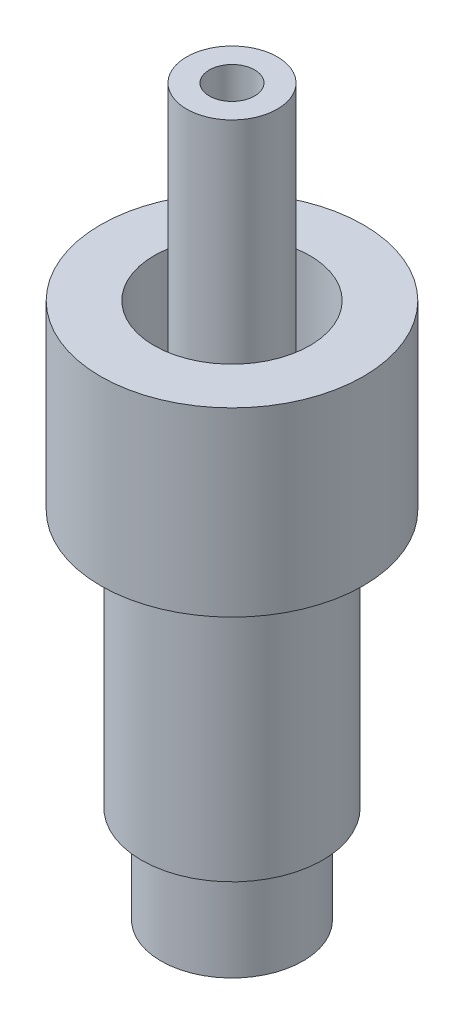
ISO-10303-21;
HEADER;
FILE_DESCRIPTION(('STEP AP214'),'2;1');
FILE_NAME('part.step','',(''),(''),'','','');
FILE_SCHEMA(('AUTOMOTIVE_DESIGN { 1 0 10303 214 1 1 1 1 }'));
ENDSEC;
DATA;
#1=APPLICATION_CONTEXT('core data for automotive mechanical design processes');
#2=APPLICATION_PROTOCOL_DEFINITION('international standard','automotive_design',2000,#1);
#3=PRODUCT_CONTEXT('',#1,'mechanical');
#4=PRODUCT('Part','Part','',(#3));
#5=PRODUCT_RELATED_PRODUCT_CATEGORY('part','',(#4));
#6=PRODUCT_DEFINITION_FORMATION('','',#4);
#7=PRODUCT_DEFINITION_CONTEXT('part definition',#1,'design');
#8=PRODUCT_DEFINITION('design','',#6,#7);
#9=PRODUCT_DEFINITION_SHAPE('','',#8);
#10=(LENGTH_UNIT() NAMED_UNIT(*) SI_UNIT(.MILLI.,.METRE.));
#11=(NAMED_UNIT(*) PLANE_ANGLE_UNIT() SI_UNIT($,.RADIAN.));
#12=(NAMED_UNIT(*) SI_UNIT($,.STERADIAN.) SOLID_ANGLE_UNIT());
#13=UNCERTAINTY_MEASURE_WITH_UNIT(LENGTH_MEASURE(1.E-05),#10,'distance_accuracy_value','');
#14=(GEOMETRIC_REPRESENTATION_CONTEXT(3) GLOBAL_UNCERTAINTY_ASSIGNED_CONTEXT((#13)) GLOBAL_UNIT_ASSIGNED_CONTEXT((#10,
#11,#12)) REPRESENTATION_CONTEXT('',''));
#15=CARTESIAN_POINT('',(0.,0.,0.));
#16=DIRECTION('',(0.,0.,1.));
#17=DIRECTION('',(1.,0.,0.));
#18=AXIS2_PLACEMENT_3D('',#15,#16,#17);
#19=CARTESIAN_POINT('',(0.,6.604,0.));
#20=DIRECTION('',(0.,-1.,0.));
#21=DIRECTION('',(0.,0.,-1.));
#22=AXIS2_PLACEMENT_3D('',#19,#20,#21);
#23=CYLINDRICAL_SURFACE('',#22,1.5875);
#24=CARTESIAN_POINT('',(0.,6.604,0.));
#25=DIRECTION('',(0.,-1.,0.));
#26=DIRECTION('',(0.,0.,-1.));
#27=AXIS2_PLACEMENT_3D('',#24,#25,#26);
#28=CIRCLE('',#27,1.5875);
#29=CARTESIAN_POINT('',(0.,6.604,-1.5875));
#30=VERTEX_POINT('',#29);
#31=EDGE_CURVE('E11',#30,#30,#28,.T.);
#32=ORIENTED_EDGE('',*,*,#31,.T.);
#33=EDGE_LOOP('',(#32));
#34=FACE_BOUND('',#33,.T.);
#35=CARTESIAN_POINT('',(0.,-18.796,0.));
#36=DIRECTION('',(0.,-1.,0.));
#37=DIRECTION('',(0.,0.,-1.));
#38=AXIS2_PLACEMENT_3D('',#35,#36,#37);
#39=CIRCLE('',#38,1.5875);
#40=CARTESIAN_POINT('',(0.,-18.796,-1.5875));
#41=VERTEX_POINT('',#40);
#42=EDGE_CURVE('E51',#41,#41,#39,.T.);
#43=ORIENTED_EDGE('',*,*,#42,.F.);
#44=EDGE_LOOP('',(#43));
#45=FACE_BOUND('',#44,.T.);
#46=ADVANCED_FACE('F48',(#34,#45),#23,.T.);
#47=CARTESIAN_POINT('',(0.,6.604,0.));
#48=DIRECTION('',(0.,-1.,0.));
#49=DIRECTION('',(0.,0.,-1.));
#50=AXIS2_PLACEMENT_3D('',#47,#48,#49);
#51=PLANE('',#50);
#52=CARTESIAN_POINT('',(0.,6.604,0.));
#53=DIRECTION('',(0.,-1.,0.));
#54=DIRECTION('',(0.,0.,-1.));
#55=AXIS2_PLACEMENT_3D('',#52,#53,#54);
#56=CIRCLE('',#55,0.79375);
#57=CARTESIAN_POINT('',(0.,6.604,-0.79375));
#58=VERTEX_POINT('',#57);
#59=EDGE_CURVE('E58',#58,#58,#56,.T.);
#60=ORIENTED_EDGE('',*,*,#59,.T.);
#61=EDGE_LOOP('',(#60));
#62=FACE_BOUND('',#61,.T.);
#63=ORIENTED_EDGE('',*,*,#31,.F.);
#64=EDGE_LOOP('',(#63));
#65=FACE_BOUND('',#64,.T.);
#66=ADVANCED_FACE('F66',(#62,#65),#51,.F.);
#67=CARTESIAN_POINT('',(0.,-18.796,0.));
#68=DIRECTION('',(0.,-1.,0.));
#69=DIRECTION('',(0.,0.,-1.));
#70=AXIS2_PLACEMENT_3D('',#67,#68,#69);
#71=PLANE('',#70);
#72=CARTESIAN_POINT('',(0.,-18.796,0.));
#73=DIRECTION('',(0.,-1.,0.));
#74=DIRECTION('',(0.,0.,-1.));
#75=AXIS2_PLACEMENT_3D('',#72,#73,#74);
#76=CIRCLE('',#75,0.79375);
#77=CARTESIAN_POINT('',(0.,-18.796,-0.79375));
#78=VERTEX_POINT('',#77);
#79=EDGE_CURVE('E60',#78,#78,#76,.T.);
#80=ORIENTED_EDGE('',*,*,#79,.F.);
#81=EDGE_LOOP('',(#80));
#82=FACE_BOUND('',#81,.T.);
#83=ORIENTED_EDGE('',*,*,#42,.T.);
#84=EDGE_LOOP('',(#83));
#85=FACE_BOUND('',#84,.T.);
#86=ADVANCED_FACE('F72',(#82,#85),#71,.T.);
#87=CARTESIAN_POINT('',(0.,6.604,0.));
#88=DIRECTION('',(0.,-1.,0.));
#89=DIRECTION('',(0.,0.,-1.));
#90=AXIS2_PLACEMENT_3D('',#87,#88,#89);
#91=CYLINDRICAL_SURFACE('',#90,0.79375);
#92=ORIENTED_EDGE('',*,*,#59,.F.);
#93=EDGE_LOOP('',(#92));
#94=FACE_BOUND('',#93,.T.);
#95=ORIENTED_EDGE('',*,*,#79,.T.);
#96=EDGE_LOOP('',(#95));
#97=FACE_BOUND('',#96,.T.);
#98=ADVANCED_FACE('F69',(#94,#97),#91,.F.);
#99=CLOSED_SHELL('',(#46,#66,#86,#98));
#100=MANIFOLD_SOLID_BREP('B2',#99);
#101=CARTESIAN_POINT('',(0.,-15.3924,0.));
#102=DIRECTION('',(0.,-1.,0.));
#103=DIRECTION('',(0.,0.,-1.));
#104=AXIS2_PLACEMENT_3D('',#101,#102,#103);
#105=PLANE('',#104);
#106=CARTESIAN_POINT('',(0.,-15.3924,0.));
#107=DIRECTION('',(0.,-1.,0.));
#108=DIRECTION('',(0.,0.,-1.));
#109=AXIS2_PLACEMENT_3D('',#106,#107,#108);
#110=CIRCLE('',#109,2.4892);
#111=CARTESIAN_POINT('',(0.,-15.3924,2.4892));
#112=VERTEX_POINT('',#111);
#113=EDGE_CURVE('E133',#112,#112,#110,.T.);
#114=ORIENTED_EDGE('',*,*,#113,.F.);
#115=EDGE_LOOP('',(#114));
#116=FACE_BOUND('',#115,.T.);
#117=CARTESIAN_POINT('',(0.,-15.3924,0.));
#118=DIRECTION('',(0.,-1.,0.));
#119=DIRECTION('',(0.,0.,-1.));
#120=AXIS2_PLACEMENT_3D('',#117,#118,#119);
#121=CIRCLE('',#120,1.5875);
#122=CARTESIAN_POINT('',(0.,-15.3924,1.5875));
#123=VERTEX_POINT('',#122);
#124=EDGE_CURVE('E142',#123,#123,#121,.T.);
#125=ORIENTED_EDGE('',*,*,#124,.T.);
#126=EDGE_LOOP('',(#125));
#127=FACE_BOUND('',#126,.T.);
#128=ADVANCED_FACE('F126',(#116,#127),#105,.F.);
#129=CARTESIAN_POINT('',(0.,-44.6325207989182,0.));
#130=DIRECTION('',(0.,1.,0.));
#131=DIRECTION('',(0.,0.,1.));
#132=AXIS2_PLACEMENT_3D('',#129,#130,#131);
#133=CYLINDRICAL_SURFACE('',#132,2.4892);
#134=CARTESIAN_POINT('',(0.,-18.796,0.));
#135=DIRECTION('',(0.,1.,0.));
#136=DIRECTION('',(0.,0.,1.));
#137=AXIS2_PLACEMENT_3D('',#134,#135,#136);
#138=CIRCLE('',#137,2.4892);
#139=CARTESIAN_POINT('',(0.,-18.796,2.4892));
#140=VERTEX_POINT('',#139);
#141=EDGE_CURVE('E137',#140,#140,#138,.T.);
#142=CARTESIAN_POINT('',(0.,-18.796,2.4892));
#143=CARTESIAN_POINT('',(0.,-18.7605458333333,2.4892));
#144=CARTESIAN_POINT('',(0.,-18.7250916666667,2.4892));
#145=CARTESIAN_POINT('',(0.,-18.6541833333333,2.4892));
#146=CARTESIAN_POINT('',(0.,-18.6187291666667,2.4892));
#147=CARTESIAN_POINT('',(0.,-18.5478208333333,2.4892));
#148=CARTESIAN_POINT('',(0.,-18.5123666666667,2.4892));
#149=CARTESIAN_POINT('',(0.,-18.4414583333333,2.4892));
#150=CARTESIAN_POINT('',(0.,-18.4060041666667,2.4892));
#151=CARTESIAN_POINT('',(0.,-18.3350958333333,2.4892));
#152=CARTESIAN_POINT('',(0.,-18.2996416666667,2.4892));
#153=CARTESIAN_POINT('',(0.,-18.2287333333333,2.4892));
#154=CARTESIAN_POINT('',(0.,-18.1932791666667,2.4892));
#155=CARTESIAN_POINT('',(0.,-18.1223708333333,2.4892));
#156=CARTESIAN_POINT('',(0.,-18.0869166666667,2.4892));
#157=CARTESIAN_POINT('',(0.,-18.0160083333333,2.4892));
#158=CARTESIAN_POINT('',(0.,-17.9805541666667,2.4892));
#159=CARTESIAN_POINT('',(0.,-17.9096458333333,2.4892));
#160=CARTESIAN_POINT('',(0.,-17.8741916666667,2.4892));
#161=CARTESIAN_POINT('',(0.,-17.8032833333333,2.4892));
#162=CARTESIAN_POINT('',(0.,-17.7678291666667,2.4892));
#163=CARTESIAN_POINT('',(0.,-17.6969208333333,2.4892));
#164=CARTESIAN_POINT('',(0.,-17.6614666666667,2.4892));
#165=CARTESIAN_POINT('',(0.,-17.5905583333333,2.4892));
#166=CARTESIAN_POINT('',(0.,-17.5551041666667,2.4892));
#167=CARTESIAN_POINT('',(0.,-17.4841958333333,2.4892));
#168=CARTESIAN_POINT('',(0.,-17.4487416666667,2.4892));
#169=CARTESIAN_POINT('',(0.,-17.3778333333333,2.4892));
#170=CARTESIAN_POINT('',(0.,-17.3423791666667,2.4892));
#171=CARTESIAN_POINT('',(0.,-17.2714708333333,2.4892));
#172=CARTESIAN_POINT('',(0.,-17.2360166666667,2.4892));
#173=CARTESIAN_POINT('',(0.,-17.1651083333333,2.4892));
#174=CARTESIAN_POINT('',(0.,-17.1296541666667,2.4892));
#175=CARTESIAN_POINT('',(0.,-17.0587458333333,2.4892));
#176=CARTESIAN_POINT('',(0.,-17.0232916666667,2.4892));
#177=CARTESIAN_POINT('',(0.,-16.9523833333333,2.4892));
#178=CARTESIAN_POINT('',(0.,-16.9169291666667,2.4892));
#179=CARTESIAN_POINT('',(0.,-16.8460208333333,2.4892));
#180=CARTESIAN_POINT('',(0.,-16.8105666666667,2.4892));
#181=CARTESIAN_POINT('',(0.,-16.7396583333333,2.4892));
#182=CARTESIAN_POINT('',(0.,-16.7042041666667,2.4892));
#183=CARTESIAN_POINT('',(0.,-16.6332958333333,2.4892));
#184=CARTESIAN_POINT('',(0.,-16.5978416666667,2.4892));
#185=CARTESIAN_POINT('',(0.,-16.5269333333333,2.4892));
#186=CARTESIAN_POINT('',(0.,-16.4914791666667,2.4892));
#187=CARTESIAN_POINT('',(0.,-16.4205708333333,2.4892));
#188=CARTESIAN_POINT('',(0.,-16.3851166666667,2.4892));
#189=CARTESIAN_POINT('',(0.,-16.3142083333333,2.4892));
#190=CARTESIAN_POINT('',(0.,-16.2787541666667,2.4892));
#191=CARTESIAN_POINT('',(0.,-16.2078458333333,2.4892));
#192=CARTESIAN_POINT('',(0.,-16.1723916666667,2.4892));
#193=CARTESIAN_POINT('',(0.,-16.1014833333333,2.4892));
#194=CARTESIAN_POINT('',(0.,-16.0660291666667,2.4892));
#195=CARTESIAN_POINT('',(0.,-15.9951208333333,2.4892));
#196=CARTESIAN_POINT('',(0.,-15.9596666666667,2.4892));
#197=CARTESIAN_POINT('',(0.,-15.8887583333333,2.4892));
#198=CARTESIAN_POINT('',(0.,-15.8533041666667,2.4892));
#199=CARTESIAN_POINT('',(0.,-15.7823958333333,2.4892));
#200=CARTESIAN_POINT('',(0.,-15.7469416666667,2.4892));
#201=CARTESIAN_POINT('',(0.,-15.6760333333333,2.4892));
#202=CARTESIAN_POINT('',(0.,-15.6405791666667,2.4892));
#203=CARTESIAN_POINT('',(0.,-15.5696708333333,2.4892));
#204=CARTESIAN_POINT('',(0.,-15.5342166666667,2.4892));
#205=CARTESIAN_POINT('',(0.,-15.4633083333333,2.4892));
#206=CARTESIAN_POINT('',(0.,-15.4278541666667,2.4892));
#207=CARTESIAN_POINT('',(0.,-15.3924,2.4892));
#208=B_SPLINE_CURVE_WITH_KNOTS('',3,(#142,#143,#144,#145,#146,#147,#148,#149,#150,#151,#152,
#153,#154,#155,#156,#157,#158,#159,#160,#161,#162,#163,#164,#165,#166,#167,#168,#169,#170,#171,
#172,#173,#174,#175,#176,#177,#178,#179,#180,#181,#182,#183,#184,#185,#186,#187,#188,#189,#190,
#191,#192,#193,#194,#195,#196,#197,#198,#199,#200,#201,#202,#203,#204,#205,#206,#207),
.UNSPECIFIED.,.F.,.F.,(4,2,2,2,2,2,2,2,2,2,2,2,2,2,2,2,2,2,2,2,2,2,2,2,2,2,2,2,2,2,2,2,4),(0.,
0.106362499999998,0.212725,0.319087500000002,0.425450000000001,0.531812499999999,
0.638175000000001,0.744537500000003,0.850900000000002,0.9572625,1.063625,1.1699875,1.27635,
1.3827125,1.489075,1.5954375,1.7018,1.8081625,1.914525,2.02088750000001,2.12725,2.2336125,
2.339975,2.44633750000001,2.55270000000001,2.6590625,2.76542500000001,2.87178750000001,
2.97815000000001,3.0845125,3.19087500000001,3.29723750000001,3.40360000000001),.UNSPECIFIED.);
#209=EDGE_CURVE('BSEAM150',#140,#112,#208,.T.);
#210=ORIENTED_EDGE('',*,*,#141,.T.);
#211=ORIENTED_EDGE('',*,*,#113,.T.);
#212=ORIENTED_EDGE('',*,*,#209,.T.);
#213=ORIENTED_EDGE('',*,*,#209,.F.);
#214=EDGE_LOOP('',(#210,#212,#211,#213));
#215=FACE_BOUND('',#214,.T.);
#216=ADVANCED_FACE('F150',(#215),#133,.T.);
#217=CARTESIAN_POINT('',(0.,-44.6325207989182,0.));
#218=DIRECTION('',(0.,1.,0.));
#219=DIRECTION('',(0.,0.,1.));
#220=AXIS2_PLACEMENT_3D('',#217,#218,#219);
#221=CYLINDRICAL_SURFACE('',#220,1.5875);
#222=CARTESIAN_POINT('',(0.,-18.796,0.));
#223=DIRECTION('',(0.,1.,0.));
#224=DIRECTION('',(0.,0.,1.));
#225=AXIS2_PLACEMENT_3D('',#222,#223,#224);
#226=CIRCLE('',#225,1.5875);
#227=CARTESIAN_POINT('',(0.,-18.796,1.5875));
#228=VERTEX_POINT('',#227);
#229=EDGE_CURVE('E47',#228,#228,#226,.T.);
#230=CARTESIAN_POINT('',(0.,-18.796,1.5875));
#231=CARTESIAN_POINT('',(0.,-18.7605458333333,1.5875));
#232=CARTESIAN_POINT('',(0.,-18.7250916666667,1.5875));
#233=CARTESIAN_POINT('',(0.,-18.6541833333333,1.5875));
#234=CARTESIAN_POINT('',(0.,-18.6187291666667,1.5875));
#235=CARTESIAN_POINT('',(0.,-18.5478208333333,1.5875));
#236=CARTESIAN_POINT('',(0.,-18.5123666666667,1.5875));
#237=CARTESIAN_POINT('',(0.,-18.4414583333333,1.5875));
#238=CARTESIAN_POINT('',(0.,-18.4060041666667,1.5875));
#239=CARTESIAN_POINT('',(0.,-18.3350958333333,1.5875));
#240=CARTESIAN_POINT('',(0.,-18.2996416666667,1.5875));
#241=CARTESIAN_POINT('',(0.,-18.2287333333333,1.5875));
#242=CARTESIAN_POINT('',(0.,-18.1932791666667,1.5875));
#243=CARTESIAN_POINT('',(0.,-18.1223708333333,1.5875));
#244=CARTESIAN_POINT('',(0.,-18.0869166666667,1.5875));
#245=CARTESIAN_POINT('',(0.,-18.0160083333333,1.5875));
#246=CARTESIAN_POINT('',(0.,-17.9805541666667,1.5875));
#247=CARTESIAN_POINT('',(0.,-17.9096458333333,1.5875));
#248=CARTESIAN_POINT('',(0.,-17.8741916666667,1.5875));
#249=CARTESIAN_POINT('',(0.,-17.8032833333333,1.5875));
#250=CARTESIAN_POINT('',(0.,-17.7678291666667,1.5875));
#251=CARTESIAN_POINT('',(0.,-17.6969208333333,1.5875));
#252=CARTESIAN_POINT('',(0.,-17.6614666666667,1.5875));
#253=CARTESIAN_POINT('',(0.,-17.5905583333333,1.5875));
#254=CARTESIAN_POINT('',(0.,-17.5551041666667,1.5875));
#255=CARTESIAN_POINT('',(0.,-17.4841958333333,1.5875));
#256=CARTESIAN_POINT('',(0.,-17.4487416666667,1.5875));
#257=CARTESIAN_POINT('',(0.,-17.3778333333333,1.5875));
#258=CARTESIAN_POINT('',(0.,-17.3423791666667,1.5875));
#259=CARTESIAN_POINT('',(0.,-17.2714708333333,1.5875));
#260=CARTESIAN_POINT('',(0.,-17.2360166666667,1.5875));
#261=CARTESIAN_POINT('',(0.,-17.1651083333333,1.5875));
#262=CARTESIAN_POINT('',(0.,-17.1296541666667,1.5875));
#263=CARTESIAN_POINT('',(0.,-17.0587458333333,1.5875));
#264=CARTESIAN_POINT('',(0.,-17.0232916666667,1.5875));
#265=CARTESIAN_POINT('',(0.,-16.9523833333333,1.5875));
#266=CARTESIAN_POINT('',(0.,-16.9169291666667,1.5875));
#267=CARTESIAN_POINT('',(0.,-16.8460208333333,1.5875));
#268=CARTESIAN_POINT('',(0.,-16.8105666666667,1.5875));
#269=CARTESIAN_POINT('',(0.,-16.7396583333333,1.5875));
#270=CARTESIAN_POINT('',(0.,-16.7042041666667,1.5875));
#271=CARTESIAN_POINT('',(0.,-16.6332958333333,1.5875));
#272=CARTESIAN_POINT('',(0.,-16.5978416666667,1.5875));
#273=CARTESIAN_POINT('',(0.,-16.5269333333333,1.5875));
#274=CARTESIAN_POINT('',(0.,-16.4914791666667,1.5875));
#275=CARTESIAN_POINT('',(0.,-16.4205708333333,1.5875));
#276=CARTESIAN_POINT('',(0.,-16.3851166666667,1.5875));
#277=CARTESIAN_POINT('',(0.,-16.3142083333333,1.5875));
#278=CARTESIAN_POINT('',(0.,-16.2787541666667,1.5875));
#279=CARTESIAN_POINT('',(0.,-16.2078458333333,1.5875));
#280=CARTESIAN_POINT('',(0.,-16.1723916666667,1.5875));
#281=CARTESIAN_POINT('',(0.,-16.1014833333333,1.5875));
#282=CARTESIAN_POINT('',(0.,-16.0660291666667,1.5875));
#283=CARTESIAN_POINT('',(0.,-15.9951208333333,1.5875));
#284=CARTESIAN_POINT('',(0.,-15.9596666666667,1.5875));
#285=CARTESIAN_POINT('',(0.,-15.8887583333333,1.5875));
#286=CARTESIAN_POINT('',(0.,-15.8533041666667,1.5875));
#287=CARTESIAN_POINT('',(0.,-15.7823958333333,1.5875));
#288=CARTESIAN_POINT('',(0.,-15.7469416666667,1.5875));
#289=CARTESIAN_POINT('',(0.,-15.6760333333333,1.5875));
#290=CARTESIAN_POINT('',(0.,-15.6405791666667,1.5875));
#291=CARTESIAN_POINT('',(0.,-15.5696708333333,1.5875));
#292=CARTESIAN_POINT('',(0.,-15.5342166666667,1.5875));
#293=CARTESIAN_POINT('',(0.,-15.4633083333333,1.5875));
#294=CARTESIAN_POINT('',(0.,-15.4278541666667,1.5875));
#295=CARTESIAN_POINT('',(0.,-15.3924,1.5875));
#296=B_SPLINE_CURVE_WITH_KNOTS('',3,(#230,#231,#232,#233,#234,#235,#236,#237,#238,#239,#240,
#241,#242,#243,#244,#245,#246,#247,#248,#249,#250,#251,#252,#253,#254,#255,#256,#257,#258,#259,
#260,#261,#262,#263,#264,#265,#266,#267,#268,#269,#270,#271,#272,#273,#274,#275,#276,#277,#278,
#279,#280,#281,#282,#283,#284,#285,#286,#287,#288,#289,#290,#291,#292,#293,#294,#295),
.UNSPECIFIED.,.F.,.F.,(4,2,2,2,2,2,2,2,2,2,2,2,2,2,2,2,2,2,2,2,2,2,2,2,2,2,2,2,2,2,2,2,4),(0.,
0.106362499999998,0.212725,0.319087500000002,0.425450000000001,0.531812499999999,
0.638175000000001,0.744537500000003,0.850900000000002,0.9572625,1.063625,1.1699875,1.27635,
1.3827125,1.489075,1.5954375,1.7018,1.8081625,1.914525,2.02088750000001,2.12725,2.2336125,
2.339975,2.44633750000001,2.55270000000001,2.6590625,2.76542500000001,2.87178750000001,
2.97815000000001,3.0845125,3.19087500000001,3.29723750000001,3.40360000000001),.UNSPECIFIED.);
#297=EDGE_CURVE('BSEAM148',#228,#123,#296,.T.);
#298=ORIENTED_EDGE('',*,*,#229,.F.);
#299=ORIENTED_EDGE('',*,*,#124,.F.);
#300=ORIENTED_EDGE('',*,*,#297,.T.);
#301=ORIENTED_EDGE('',*,*,#297,.F.);
#302=EDGE_LOOP('',(#298,#300,#299,#301));
#303=FACE_BOUND('',#302,.T.);
#304=ADVANCED_FACE('F148',(#303),#221,.F.);
#305=CARTESIAN_POINT('',(-1.5875,-18.796,0.));
#306=DIRECTION('',(0.,1.,0.));
#307=DIRECTION('',(0.,0.,1.));
#308=AXIS2_PLACEMENT_3D('',#305,#306,#307);
#309=PLANE('',#308);
#310=ORIENTED_EDGE('',*,*,#229,.T.);
#311=EDGE_LOOP('',(#310));
#312=FACE_BOUND('',#311,.T.);
#313=ORIENTED_EDGE('',*,*,#141,.F.);
#314=EDGE_LOOP('',(#313));
#315=FACE_BOUND('',#314,.T.);
#316=ADVANCED_FACE('F128',(#312,#315),#309,.F.);
#317=CLOSED_SHELL('',(#128,#216,#304,#316));
#318=MANIFOLD_SOLID_BREP('B6',#317);
#319=CARTESIAN_POINT('',(0.,0.,0.));
#320=DIRECTION('',(0.,1.,0.));
#321=DIRECTION('',(0.,0.,1.));
#322=AXIS2_PLACEMENT_3D('',#319,#320,#321);
#323=CYLINDRICAL_SURFACE('',#322,1.5875);
#324=CARTESIAN_POINT('',(0.,-15.3924,0.));
#325=DIRECTION('',(0.,1.,0.));
#326=DIRECTION('',(0.,0.,1.));
#327=AXIS2_PLACEMENT_3D('',#324,#325,#326);
#328=CIRCLE('',#327,1.5875);
#329=CARTESIAN_POINT('',(0.,-15.3924,1.5875));
#330=VERTEX_POINT('',#329);
#331=EDGE_CURVE('E216',#330,#330,#328,.T.);
#332=ORIENTED_EDGE('',*,*,#331,.F.);
#333=EDGE_LOOP('',(#332));
#334=FACE_BOUND('',#333,.T.);
#335=CARTESIAN_POINT('',(0.,-5.461,0.));
#336=DIRECTION('',(0.,1.,0.));
#337=DIRECTION('',(0.,0.,1.));
#338=AXIS2_PLACEMENT_3D('',#335,#336,#337);
#339=CIRCLE('',#338,1.5875);
#340=CARTESIAN_POINT('',(0.,-5.461,1.5875));
#341=VERTEX_POINT('',#340);
#342=EDGE_CURVE('E200',#341,#341,#339,.T.);
#343=ORIENTED_EDGE('',*,*,#342,.T.);
#344=EDGE_LOOP('',(#343));
#345=FACE_BOUND('',#344,.T.);
#346=ADVANCED_FACE('F197',(#334,#345),#323,.F.);
#347=CARTESIAN_POINT('',(-1.5875,0.,0.));
#348=DIRECTION('',(0.,1.,0.));
#349=DIRECTION('',(0.,0.,1.));
#350=AXIS2_PLACEMENT_3D('',#347,#348,#349);
#351=PLANE('',#350);
#352=CARTESIAN_POINT('',(0.,0.,0.));
#353=DIRECTION('',(0.,1.,0.));
#354=DIRECTION('',(0.,0.,1.));
#355=AXIS2_PLACEMENT_3D('',#352,#353,#354);
#356=CIRCLE('',#355,2.7305);
#357=CARTESIAN_POINT('',(0.,0.,2.7305));
#358=VERTEX_POINT('',#357);
#359=EDGE_CURVE('E219',#358,#358,#356,.T.);
#360=ORIENTED_EDGE('',*,*,#359,.F.);
#361=EDGE_LOOP('',(#360));
#362=FACE_BOUND('',#361,.T.);
#363=CARTESIAN_POINT('',(0.,0.,0.));
#364=DIRECTION('',(0.,1.,0.));
#365=DIRECTION('',(0.,0.,1.));
#366=AXIS2_PLACEMENT_3D('',#363,#364,#365);
#367=CIRCLE('',#366,4.60375);
#368=CARTESIAN_POINT('',(0.,0.,4.60375));
#369=VERTEX_POINT('',#368);
#370=EDGE_CURVE('E125',#369,#369,#367,.T.);
#371=ORIENTED_EDGE('',*,*,#370,.T.);
#372=EDGE_LOOP('',(#371));
#373=FACE_BOUND('',#372,.T.);
#374=ADVANCED_FACE('F241',(#362,#373),#351,.T.);
#375=CARTESIAN_POINT('',(0.,0.,0.));
#376=DIRECTION('',(0.,1.,0.));
#377=DIRECTION('',(0.,0.,1.));
#378=AXIS2_PLACEMENT_3D('',#375,#376,#377);
#379=CYLINDRICAL_SURFACE('',#378,4.60375);
#380=CARTESIAN_POINT('',(0.,-6.35,0.));
#381=DIRECTION('',(0.,1.,0.));
#382=DIRECTION('',(0.,0.,1.));
#383=AXIS2_PLACEMENT_3D('',#380,#381,#382);
#384=CIRCLE('',#383,4.60375);
#385=CARTESIAN_POINT('',(0.,-6.35,4.60375));
#386=VERTEX_POINT('',#385);
#387=EDGE_CURVE('E204',#386,#386,#384,.T.);
#388=ORIENTED_EDGE('',*,*,#387,.T.);
#389=EDGE_LOOP('',(#388));
#390=FACE_BOUND('',#389,.T.);
#391=ORIENTED_EDGE('',*,*,#370,.F.);
#392=EDGE_LOOP('',(#391));
#393=FACE_BOUND('',#392,.T.);
#394=ADVANCED_FACE('F246',(#390,#393),#379,.T.);
#395=CARTESIAN_POINT('',(-4.60375,-6.35,0.));
#396=DIRECTION('',(0.,-1.,0.));
#397=DIRECTION('',(0.,0.,-1.));
#398=AXIS2_PLACEMENT_3D('',#395,#396,#397);
#399=PLANE('',#398);
#400=CARTESIAN_POINT('',(0.,-6.35,0.));
#401=DIRECTION('',(0.,1.,0.));
#402=DIRECTION('',(0.,0.,1.));
#403=AXIS2_PLACEMENT_3D('',#400,#401,#402);
#404=CIRCLE('',#403,3.175);
#405=CARTESIAN_POINT('',(0.,-6.35,3.175));
#406=VERTEX_POINT('',#405);
#407=EDGE_CURVE('E208',#406,#406,#404,.T.);
#408=ORIENTED_EDGE('',*,*,#407,.T.);
#409=EDGE_LOOP('',(#408));
#410=FACE_BOUND('',#409,.T.);
#411=ORIENTED_EDGE('',*,*,#387,.F.);
#412=EDGE_LOOP('',(#411));
#413=FACE_BOUND('',#412,.T.);
#414=ADVANCED_FACE('F258',(#410,#413),#399,.T.);
#415=CARTESIAN_POINT('',(0.,0.,0.));
#416=DIRECTION('',(0.,1.,0.));
#417=DIRECTION('',(0.,0.,1.));
#418=AXIS2_PLACEMENT_3D('',#415,#416,#417);
#419=CYLINDRICAL_SURFACE('',#418,3.175);
#420=CARTESIAN_POINT('',(0.,-15.3924,0.));
#421=DIRECTION('',(0.,1.,0.));
#422=DIRECTION('',(0.,0.,1.));
#423=AXIS2_PLACEMENT_3D('',#420,#421,#422);
#424=CIRCLE('',#423,3.175);
#425=CARTESIAN_POINT('',(0.,-15.3924,3.175));
#426=VERTEX_POINT('',#425);
#427=EDGE_CURVE('E213',#426,#426,#424,.T.);
#428=ORIENTED_EDGE('',*,*,#427,.T.);
#429=EDGE_LOOP('',(#428));
#430=FACE_BOUND('',#429,.T.);
#431=ORIENTED_EDGE('',*,*,#407,.F.);
#432=EDGE_LOOP('',(#431));
#433=FACE_BOUND('',#432,.T.);
#434=ADVANCED_FACE('F252',(#430,#433),#419,.T.);
#435=CARTESIAN_POINT('',(-3.175,-15.3924,0.));
#436=DIRECTION('',(0.,-1.,0.));
#437=DIRECTION('',(0.,0.,-1.));
#438=AXIS2_PLACEMENT_3D('',#435,#436,#437);
#439=PLANE('',#438);
#440=ORIENTED_EDGE('',*,*,#331,.T.);
#441=EDGE_LOOP('',(#440));
#442=FACE_BOUND('',#441,.T.);
#443=ORIENTED_EDGE('',*,*,#427,.F.);
#444=EDGE_LOOP('',(#443));
#445=FACE_BOUND('',#444,.T.);
#446=ADVANCED_FACE('F237',(#442,#445),#439,.T.);
#447=CARTESIAN_POINT('',(0.,-5.461,0.));
#448=DIRECTION('',(0.,1.,0.));
#449=DIRECTION('',(0.,0.,1.));
#450=AXIS2_PLACEMENT_3D('',#447,#448,#449);
#451=CYLINDRICAL_SURFACE('',#450,2.7305);
#452=CARTESIAN_POINT('',(0.,-5.461,0.));
#453=DIRECTION('',(0.,1.,0.));
#454=DIRECTION('',(0.,0.,1.));
#455=AXIS2_PLACEMENT_3D('',#452,#453,#454);
#456=CIRCLE('',#455,2.7305);
#457=CARTESIAN_POINT('',(0.,-5.461,2.7305));
#458=VERTEX_POINT('',#457);
#459=EDGE_CURVE('E222',#458,#458,#456,.T.);
#460=ORIENTED_EDGE('',*,*,#459,.F.);
#461=EDGE_LOOP('',(#460));
#462=FACE_BOUND('',#461,.T.);
#463=ORIENTED_EDGE('',*,*,#359,.T.);
#464=EDGE_LOOP('',(#463));
#465=FACE_BOUND('',#464,.T.);
#466=ADVANCED_FACE('F232',(#462,#465),#451,.F.);
#467=CARTESIAN_POINT('',(0.,-5.461,0.));
#468=DIRECTION('',(0.,1.,0.));
#469=DIRECTION('',(0.,0.,1.));
#470=AXIS2_PLACEMENT_3D('',#467,#468,#469);
#471=PLANE('',#470);
#472=ORIENTED_EDGE('',*,*,#342,.F.);
#473=EDGE_LOOP('',(#472));
#474=FACE_BOUND('',#473,.T.);
#475=ORIENTED_EDGE('',*,*,#459,.T.);
#476=EDGE_LOOP('',(#475));
#477=FACE_BOUND('',#476,.T.);
#478=ADVANCED_FACE('F230',(#474,#477),#471,.T.);
#479=CLOSED_SHELL('',(#346,#374,#394,#414,#434,#446,#466,#478));
#480=MANIFOLD_SOLID_BREP('B42',#479);
#481=ADVANCED_BREP_SHAPE_REPRESENTATION('',(#18,#100,#318,#480),#14);
#482=SHAPE_DEFINITION_REPRESENTATION(#9,#481);
ENDSEC;
END-ISO-10303-21;
